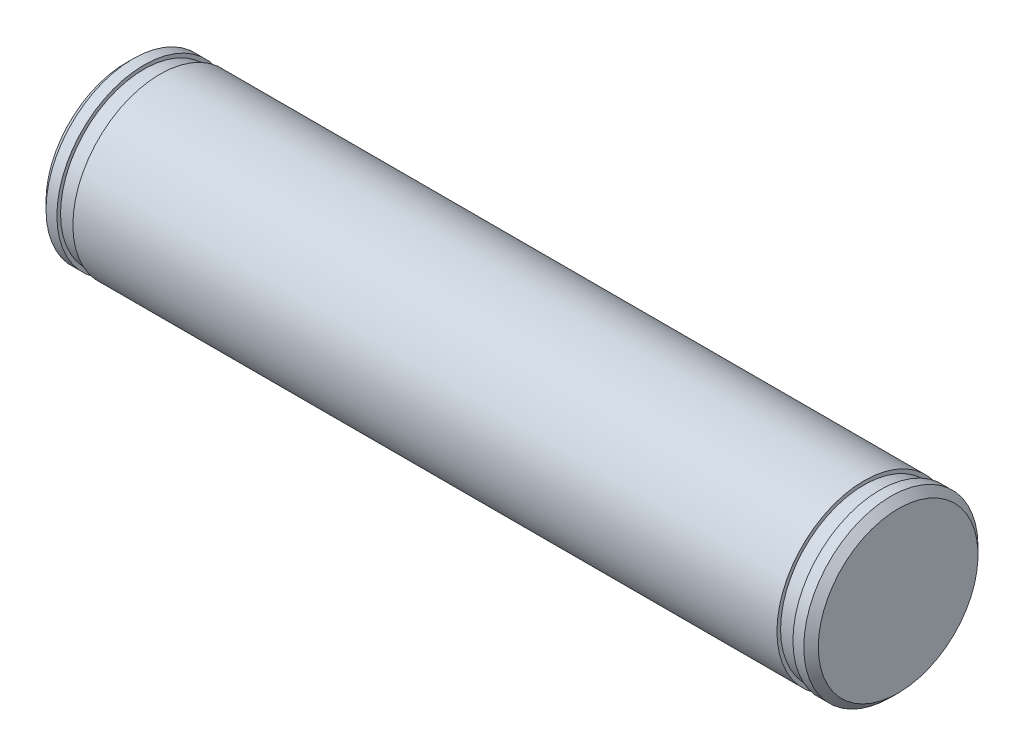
ISO-10303-21;
HEADER;
FILE_DESCRIPTION(('STEP AP214'),'2;1');
FILE_NAME('part.step','',(''),(''),'','','');
FILE_SCHEMA(('AUTOMOTIVE_DESIGN { 1 0 10303 214 1 1 1 1 }'));
ENDSEC;
DATA;
#1=APPLICATION_CONTEXT('core data for automotive mechanical design processes');
#2=APPLICATION_PROTOCOL_DEFINITION('international standard','automotive_design',2000,#1);
#3=PRODUCT_CONTEXT('',#1,'mechanical');
#4=PRODUCT('Part','Part','',(#3));
#5=PRODUCT_RELATED_PRODUCT_CATEGORY('part','',(#4));
#6=PRODUCT_DEFINITION_FORMATION('','',#4);
#7=PRODUCT_DEFINITION_CONTEXT('part definition',#1,'design');
#8=PRODUCT_DEFINITION('design','',#6,#7);
#9=PRODUCT_DEFINITION_SHAPE('','',#8);
#10=(LENGTH_UNIT() NAMED_UNIT(*) SI_UNIT(.MILLI.,.METRE.));
#11=(NAMED_UNIT(*) PLANE_ANGLE_UNIT() SI_UNIT($,.RADIAN.));
#12=(NAMED_UNIT(*) SI_UNIT($,.STERADIAN.) SOLID_ANGLE_UNIT());
#13=UNCERTAINTY_MEASURE_WITH_UNIT(LENGTH_MEASURE(1.E-05),#10,'distance_accuracy_value','');
#14=(GEOMETRIC_REPRESENTATION_CONTEXT(3) GLOBAL_UNCERTAINTY_ASSIGNED_CONTEXT((#13)) GLOBAL_UNIT_ASSIGNED_CONTEXT((#10,
#11,#12)) REPRESENTATION_CONTEXT('',''));
#15=CARTESIAN_POINT('',(0.,0.,0.));
#16=DIRECTION('',(0.,0.,1.));
#17=DIRECTION('',(1.,0.,0.));
#18=AXIS2_PLACEMENT_3D('',#15,#16,#17);
#19=CARTESIAN_POINT('',(0.,0.,0.));
#20=DIRECTION('',(1.,0.,0.));
#21=DIRECTION('',(0.,0.,-1.));
#22=AXIS2_PLACEMENT_3D('',#19,#20,#21);
#23=PLANE('',#22);
#24=CARTESIAN_POINT('',(0.,0.,0.));
#25=DIRECTION('',(-1.,0.,0.));
#26=DIRECTION('',(0.,0.,1.));
#27=AXIS2_PLACEMENT_3D('',#24,#25,#26);
#28=CIRCLE('',#27,5.5);
#29=CARTESIAN_POINT('',(0.,0.,5.5));
#30=VERTEX_POINT('',#29);
#31=EDGE_CURVE('E10',#30,#30,#28,.T.);
#32=ORIENTED_EDGE('',*,*,#31,.T.);
#33=EDGE_LOOP('',(#32));
#34=FACE_BOUND('',#33,.T.);
#35=ADVANCED_FACE('F28',(#34),#23,.F.);
#36=CARTESIAN_POINT('',(0.5,0.,0.));
#37=DIRECTION('',(1.,0.,0.));
#38=DIRECTION('',(0.,0.,-1.));
#39=AXIS2_PLACEMENT_3D('',#36,#37,#38);
#40=CONICAL_SURFACE('',#39,6.,0.785398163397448);
#41=ORIENTED_EDGE('',*,*,#31,.F.);
#42=EDGE_LOOP('',(#41));
#43=FACE_BOUND('',#42,.T.);
#44=CARTESIAN_POINT('',(0.5,0.,0.));
#45=DIRECTION('',(-1.,0.,0.));
#46=DIRECTION('',(0.,0.,1.));
#47=AXIS2_PLACEMENT_3D('',#44,#45,#46);
#48=CIRCLE('',#47,6.);
#49=CARTESIAN_POINT('',(0.5,0.,6.));
#50=VERTEX_POINT('',#49);
#51=EDGE_CURVE('E34',#50,#50,#48,.T.);
#52=ORIENTED_EDGE('',*,*,#51,.T.);
#53=EDGE_LOOP('',(#52));
#54=FACE_BOUND('',#53,.T.);
#55=ADVANCED_FACE('F84',(#43,#54),#40,.T.);
#56=CARTESIAN_POINT('',(-14.2398773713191,0.,0.));
#57=DIRECTION('',(-1.,0.,0.));
#58=DIRECTION('',(0.,0.,1.));
#59=AXIS2_PLACEMENT_3D('',#56,#57,#58);
#60=CYLINDRICAL_SURFACE('',#59,6.);
#61=ORIENTED_EDGE('',*,*,#51,.F.);
#62=EDGE_LOOP('',(#61));
#63=FACE_BOUND('',#62,.T.);
#64=CARTESIAN_POINT('',(1.25,0.,0.));
#65=DIRECTION('',(-1.,0.,0.));
#66=DIRECTION('',(0.,0.,1.));
#67=AXIS2_PLACEMENT_3D('',#64,#65,#66);
#68=CIRCLE('',#67,6.);
#69=CARTESIAN_POINT('',(1.25,0.,6.));
#70=VERTEX_POINT('',#69);
#71=EDGE_CURVE('E38',#70,#70,#68,.T.);
#72=ORIENTED_EDGE('',*,*,#71,.T.);
#73=EDGE_LOOP('',(#72));
#74=FACE_BOUND('',#73,.T.);
#75=ADVANCED_FACE('F88',(#63,#74),#60,.T.);
#76=CARTESIAN_POINT('',(1.25,6.,0.));
#77=DIRECTION('',(-1.,0.,0.));
#78=DIRECTION('',(0.,0.,1.));
#79=AXIS2_PLACEMENT_3D('',#76,#77,#78);
#80=PLANE('',#79);
#81=ORIENTED_EDGE('',*,*,#71,.F.);
#82=EDGE_LOOP('',(#81));
#83=FACE_BOUND('',#82,.T.);
#84=CARTESIAN_POINT('',(1.25,0.,0.));
#85=DIRECTION('',(-1.,0.,0.));
#86=DIRECTION('',(0.,0.,1.));
#87=AXIS2_PLACEMENT_3D('',#84,#85,#86);
#88=CIRCLE('',#87,5.75);
#89=CARTESIAN_POINT('',(1.25,0.,5.75));
#90=VERTEX_POINT('',#89);
#91=EDGE_CURVE('E42',#90,#90,#88,.T.);
#92=ORIENTED_EDGE('',*,*,#91,.T.);
#93=EDGE_LOOP('',(#92));
#94=FACE_BOUND('',#93,.T.);
#95=ADVANCED_FACE('F93',(#83,#94),#80,.F.);
#96=CARTESIAN_POINT('',(-14.2398773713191,0.,0.));
#97=DIRECTION('',(-1.,0.,0.));
#98=DIRECTION('',(0.,0.,1.));
#99=AXIS2_PLACEMENT_3D('',#96,#97,#98);
#100=CYLINDRICAL_SURFACE('',#99,5.75);
#101=ORIENTED_EDGE('',*,*,#91,.F.);
#102=EDGE_LOOP('',(#101));
#103=FACE_BOUND('',#102,.T.);
#104=CARTESIAN_POINT('',(2.35,0.,0.));
#105=DIRECTION('',(-1.,0.,0.));
#106=DIRECTION('',(0.,0.,1.));
#107=AXIS2_PLACEMENT_3D('',#104,#105,#106);
#108=CIRCLE('',#107,5.75);
#109=CARTESIAN_POINT('',(2.35,0.,5.75));
#110=VERTEX_POINT('',#109);
#111=EDGE_CURVE('E47',#110,#110,#108,.T.);
#112=ORIENTED_EDGE('',*,*,#111,.T.);
#113=EDGE_LOOP('',(#112));
#114=FACE_BOUND('',#113,.T.);
#115=ADVANCED_FACE('F99',(#103,#114),#100,.T.);
#116=CARTESIAN_POINT('',(2.35,5.75,0.));
#117=DIRECTION('',(1.,0.,0.));
#118=DIRECTION('',(0.,0.,-1.));
#119=AXIS2_PLACEMENT_3D('',#116,#117,#118);
#120=PLANE('',#119);
#121=ORIENTED_EDGE('',*,*,#111,.F.);
#122=EDGE_LOOP('',(#121));
#123=FACE_BOUND('',#122,.T.);
#124=CARTESIAN_POINT('',(2.35,0.,0.));
#125=DIRECTION('',(-1.,0.,0.));
#126=DIRECTION('',(0.,0.,1.));
#127=AXIS2_PLACEMENT_3D('',#124,#125,#126);
#128=CIRCLE('',#127,6.);
#129=CARTESIAN_POINT('',(2.35,0.,6.));
#130=VERTEX_POINT('',#129);
#131=EDGE_CURVE('E50',#130,#130,#128,.T.);
#132=ORIENTED_EDGE('',*,*,#131,.T.);
#133=EDGE_LOOP('',(#132));
#134=FACE_BOUND('',#133,.T.);
#135=ADVANCED_FACE('F103',(#123,#134),#120,.F.);
#136=CARTESIAN_POINT('',(-14.2398773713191,0.,0.));
#137=DIRECTION('',(-1.,0.,0.));
#138=DIRECTION('',(0.,0.,1.));
#139=AXIS2_PLACEMENT_3D('',#136,#137,#138);
#140=CYLINDRICAL_SURFACE('',#139,6.);
#141=ORIENTED_EDGE('',*,*,#131,.F.);
#142=EDGE_LOOP('',(#141));
#143=FACE_BOUND('',#142,.T.);
#144=CARTESIAN_POINT('',(50.85,0.,0.));
#145=DIRECTION('',(-1.,0.,0.));
#146=DIRECTION('',(0.,0.,1.));
#147=AXIS2_PLACEMENT_3D('',#144,#145,#146);
#148=CIRCLE('',#147,6.);
#149=CARTESIAN_POINT('',(50.85,0.,6.));
#150=VERTEX_POINT('',#149);
#151=EDGE_CURVE('E53',#150,#150,#148,.T.);
#152=ORIENTED_EDGE('',*,*,#151,.T.);
#153=EDGE_LOOP('',(#152));
#154=FACE_BOUND('',#153,.T.);
#155=ADVANCED_FACE('F107',(#143,#154),#140,.T.);
#156=CARTESIAN_POINT('',(50.85,6.,0.));
#157=DIRECTION('',(-1.,0.,0.));
#158=DIRECTION('',(0.,0.,1.));
#159=AXIS2_PLACEMENT_3D('',#156,#157,#158);
#160=PLANE('',#159);
#161=ORIENTED_EDGE('',*,*,#151,.F.);
#162=EDGE_LOOP('',(#161));
#163=FACE_BOUND('',#162,.T.);
#164=CARTESIAN_POINT('',(50.85,0.,0.));
#165=DIRECTION('',(-1.,0.,0.));
#166=DIRECTION('',(0.,0.,1.));
#167=AXIS2_PLACEMENT_3D('',#164,#165,#166);
#168=CIRCLE('',#167,5.75);
#169=CARTESIAN_POINT('',(50.85,0.,5.75));
#170=VERTEX_POINT('',#169);
#171=EDGE_CURVE('E56',#170,#170,#168,.T.);
#172=ORIENTED_EDGE('',*,*,#171,.T.);
#173=EDGE_LOOP('',(#172));
#174=FACE_BOUND('',#173,.T.);
#175=ADVANCED_FACE('F111',(#163,#174),#160,.F.);
#176=CARTESIAN_POINT('',(-14.2398773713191,0.,0.));
#177=DIRECTION('',(-1.,0.,0.));
#178=DIRECTION('',(0.,0.,1.));
#179=AXIS2_PLACEMENT_3D('',#176,#177,#178);
#180=CYLINDRICAL_SURFACE('',#179,5.75);
#181=ORIENTED_EDGE('',*,*,#171,.F.);
#182=EDGE_LOOP('',(#181));
#183=FACE_BOUND('',#182,.T.);
#184=CARTESIAN_POINT('',(51.95,0.,0.));
#185=DIRECTION('',(-1.,0.,0.));
#186=DIRECTION('',(0.,0.,1.));
#187=AXIS2_PLACEMENT_3D('',#184,#185,#186);
#188=CIRCLE('',#187,5.75);
#189=CARTESIAN_POINT('',(51.95,0.,5.75));
#190=VERTEX_POINT('',#189);
#191=EDGE_CURVE('E59',#190,#190,#188,.T.);
#192=ORIENTED_EDGE('',*,*,#191,.T.);
#193=EDGE_LOOP('',(#192));
#194=FACE_BOUND('',#193,.T.);
#195=ADVANCED_FACE('F115',(#183,#194),#180,.T.);
#196=CARTESIAN_POINT('',(51.95,5.75,0.));
#197=DIRECTION('',(1.,0.,0.));
#198=DIRECTION('',(0.,0.,-1.));
#199=AXIS2_PLACEMENT_3D('',#196,#197,#198);
#200=PLANE('',#199);
#201=ORIENTED_EDGE('',*,*,#191,.F.);
#202=EDGE_LOOP('',(#201));
#203=FACE_BOUND('',#202,.T.);
#204=CARTESIAN_POINT('',(51.95,0.,0.));
#205=DIRECTION('',(-1.,0.,0.));
#206=DIRECTION('',(0.,0.,1.));
#207=AXIS2_PLACEMENT_3D('',#204,#205,#206);
#208=CIRCLE('',#207,6.);
#209=CARTESIAN_POINT('',(51.95,0.,6.));
#210=VERTEX_POINT('',#209);
#211=EDGE_CURVE('E62',#210,#210,#208,.T.);
#212=ORIENTED_EDGE('',*,*,#211,.T.);
#213=EDGE_LOOP('',(#212));
#214=FACE_BOUND('',#213,.T.);
#215=ADVANCED_FACE('F119',(#203,#214),#200,.F.);
#216=CARTESIAN_POINT('',(-14.2398773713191,0.,0.));
#217=DIRECTION('',(-1.,0.,0.));
#218=DIRECTION('',(0.,0.,1.));
#219=AXIS2_PLACEMENT_3D('',#216,#217,#218);
#220=CYLINDRICAL_SURFACE('',#219,6.);
#221=ORIENTED_EDGE('',*,*,#211,.F.);
#222=EDGE_LOOP('',(#221));
#223=FACE_BOUND('',#222,.T.);
#224=CARTESIAN_POINT('',(52.7,0.,0.));
#225=DIRECTION('',(-1.,0.,0.));
#226=DIRECTION('',(0.,0.,1.));
#227=AXIS2_PLACEMENT_3D('',#224,#225,#226);
#228=CIRCLE('',#227,6.);
#229=CARTESIAN_POINT('',(52.7,0.,6.));
#230=VERTEX_POINT('',#229);
#231=EDGE_CURVE('E65',#230,#230,#228,.T.);
#232=ORIENTED_EDGE('',*,*,#231,.T.);
#233=EDGE_LOOP('',(#232));
#234=FACE_BOUND('',#233,.T.);
#235=ADVANCED_FACE('F80',(#223,#234),#220,.T.);
#236=CARTESIAN_POINT('',(53.2,0.,0.));
#237=DIRECTION('',(-1.,0.,0.));
#238=DIRECTION('',(0.,0.,1.));
#239=AXIS2_PLACEMENT_3D('',#236,#237,#238);
#240=CONICAL_SURFACE('',#239,5.5,0.785398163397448);
#241=ORIENTED_EDGE('',*,*,#231,.F.);
#242=EDGE_LOOP('',(#241));
#243=FACE_BOUND('',#242,.T.);
#244=CARTESIAN_POINT('',(53.2,0.,0.));
#245=DIRECTION('',(-1.,0.,0.));
#246=DIRECTION('',(0.,0.,1.));
#247=AXIS2_PLACEMENT_3D('',#244,#245,#246);
#248=CIRCLE('',#247,5.5);
#249=CARTESIAN_POINT('',(53.2,0.,5.5));
#250=VERTEX_POINT('',#249);
#251=EDGE_CURVE('E68',#250,#250,#248,.T.);
#252=ORIENTED_EDGE('',*,*,#251,.T.);
#253=EDGE_LOOP('',(#252));
#254=FACE_BOUND('',#253,.T.);
#255=ADVANCED_FACE('F72',(#243,#254),#240,.T.);
#256=CARTESIAN_POINT('',(53.2,5.5,0.));
#257=DIRECTION('',(-1.,0.,0.));
#258=DIRECTION('',(0.,0.,1.));
#259=AXIS2_PLACEMENT_3D('',#256,#257,#258);
#260=PLANE('',#259);
#261=ORIENTED_EDGE('',*,*,#251,.F.);
#262=EDGE_LOOP('',(#261));
#263=FACE_BOUND('',#262,.T.);
#264=ADVANCED_FACE('F74',(#263),#260,.F.);
#265=CLOSED_SHELL('',(#35,#55,#75,#95,#115,#135,#155,#175,#195,#215,#235,#255,#264));
#266=MANIFOLD_SOLID_BREP('B2',#265);
#267=ADVANCED_BREP_SHAPE_REPRESENTATION('',(#18,#266),#14);
#268=SHAPE_DEFINITION_REPRESENTATION(#9,#267);
ENDSEC;
END-ISO-10303-21;
